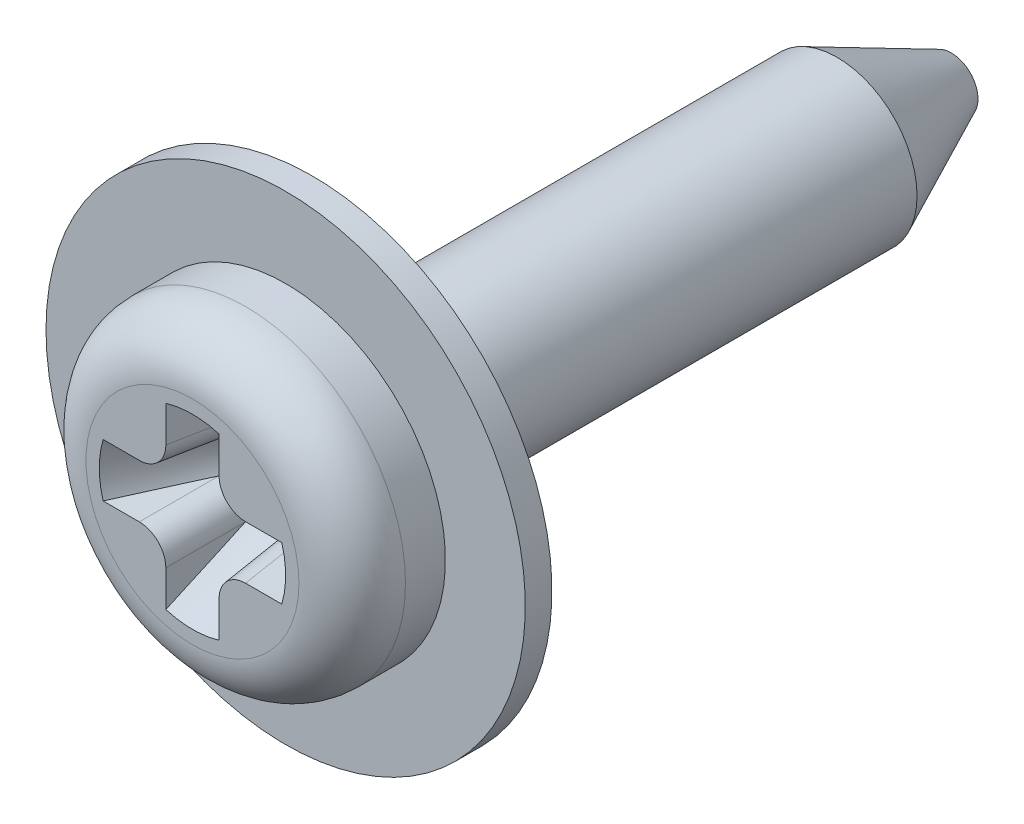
ISO-10303-21;
HEADER;
FILE_DESCRIPTION(('STEP AP214'),'2;1');
FILE_NAME('part.step','',(''),(''),'','','');
FILE_SCHEMA(('AUTOMOTIVE_DESIGN { 1 0 10303 214 1 1 1 1 }'));
ENDSEC;
DATA;
#1=APPLICATION_CONTEXT('core data for automotive mechanical design processes');
#2=APPLICATION_PROTOCOL_DEFINITION('international standard','automotive_design',2000,#1);
#3=PRODUCT_CONTEXT('',#1,'mechanical');
#4=PRODUCT('Part','Part','',(#3));
#5=PRODUCT_RELATED_PRODUCT_CATEGORY('part','',(#4));
#6=PRODUCT_DEFINITION_FORMATION('','',#4);
#7=PRODUCT_DEFINITION_CONTEXT('part definition',#1,'design');
#8=PRODUCT_DEFINITION('design','',#6,#7);
#9=PRODUCT_DEFINITION_SHAPE('','',#8);
#10=(LENGTH_UNIT() NAMED_UNIT(*) SI_UNIT(.MILLI.,.METRE.));
#11=(NAMED_UNIT(*) PLANE_ANGLE_UNIT() SI_UNIT($,.RADIAN.));
#12=(NAMED_UNIT(*) SI_UNIT($,.STERADIAN.) SOLID_ANGLE_UNIT());
#13=UNCERTAINTY_MEASURE_WITH_UNIT(LENGTH_MEASURE(1.E-05),#10,'distance_accuracy_value','');
#14=(GEOMETRIC_REPRESENTATION_CONTEXT(3) GLOBAL_UNCERTAINTY_ASSIGNED_CONTEXT((#13)) GLOBAL_UNIT_ASSIGNED_CONTEXT((#10,
#11,#12)) REPRESENTATION_CONTEXT('',''));
#15=CARTESIAN_POINT('',(0.,0.,0.));
#16=DIRECTION('',(0.,0.,1.));
#17=DIRECTION('',(1.,0.,0.));
#18=AXIS2_PLACEMENT_3D('',#15,#16,#17);
#19=CARTESIAN_POINT('',(0.,0.,14.25));
#20=DIRECTION('',(0.,0.,1.));
#21=DIRECTION('',(1.,0.,0.));
#22=AXIS2_PLACEMENT_3D('',#19,#20,#21);
#23=CONICAL_SURFACE('',#22,1.75,0.5235987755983);
#24=CARTESIAN_POINT('',(0.500017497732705,1.67716625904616,14.2502));
#25=CARTESIAN_POINT('',(0.489050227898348,1.60490105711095,14.1248435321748));
#26=CARTESIAN_POINT('',(0.478085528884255,1.53258418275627,13.9995164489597));
#27=CARTESIAN_POINT('',(0.456166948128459,1.38773778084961,13.7489859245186));
#28=CARTESIAN_POINT('',(0.445213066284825,1.31520825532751,13.6237824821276));
#29=CARTESIAN_POINT('',(0.423321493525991,1.16982525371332,13.3735606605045));
#30=CARTESIAN_POINT('',(0.412383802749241,1.09697177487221,13.2485422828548));
#31=CARTESIAN_POINT('',(0.395999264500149,0.98725732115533,13.0612661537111));
#32=CARTESIAN_POINT('',(0.390541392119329,0.950613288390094,12.9988823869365));
#33=CARTESIAN_POINT('',(0.379636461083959,0.877113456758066,12.8742384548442));
#34=CARTESIAN_POINT('',(0.374189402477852,0.840257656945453,12.8119782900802));
#35=CARTESIAN_POINT('',(0.368749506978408,0.803262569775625,12.7498));
#36=B_SPLINE_CURVE_WITH_KNOTS('',3,(#24,#25,#26,#27,#28,#29,#30,#31,#32,#33,#34,#35),
.UNSPECIFIED.,.F.,.F.,(4,2,2,2,2,4),(0.,0.435328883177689,0.870653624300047,1.30598206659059,
1.52364836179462,1.74131562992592),.UNSPECIFIED.);
#37=CARTESIAN_POINT('',(0.5,1.67705098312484,14.25));
#38=VERTEX_POINT('',#37);
#39=CARTESIAN_POINT('',(0.379752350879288,0.877849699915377,12.8755630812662));
#40=VERTEX_POINT('',#39);
#41=EDGE_CURVE('E150',#38,#40,#36,.T.);
#42=ORIENTED_EDGE('',*,*,#41,.F.);
#43=CARTESIAN_POINT('',(0.,0.,14.25));
#44=DIRECTION('',(0.,0.,1.));
#45=DIRECTION('',(1.,0.,0.));
#46=AXIS2_PLACEMENT_3D('',#43,#44,#45);
#47=CIRCLE('',#46,1.75);
#48=CARTESIAN_POINT('',(-0.5,1.67705098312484,14.25));
#49=VERTEX_POINT('',#48);
#50=EDGE_CURVE('E161',#38,#49,#47,.T.);
#51=ORIENTED_EDGE('',*,*,#50,.T.);
#52=CARTESIAN_POINT('',(-0.368749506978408,0.803262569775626,12.7498));
#53=CARTESIAN_POINT('',(-0.376113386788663,0.853329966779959,12.8339695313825));
#54=CARTESIAN_POINT('',(-0.383489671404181,0.903155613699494,12.9182808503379));
#55=CARTESIAN_POINT('',(-0.398259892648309,1.00246023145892,13.0871052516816));
#56=CARTESIAN_POINT('',(-0.405653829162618,1.05193920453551,13.1716183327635));
#57=CARTESIAN_POINT('',(-0.427851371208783,1.20006129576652,13.4253373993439));
#58=CARTESIAN_POINT('',(-0.44267086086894,1.29839060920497,13.5947249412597));
#59=CARTESIAN_POINT('',(-0.46458277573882,1.44336944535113,13.8451792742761));
#60=CARTESIAN_POINT('',(-0.471667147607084,1.49017956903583,13.9261540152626));
#61=CARTESIAN_POINT('',(-0.485839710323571,1.58372456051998,14.0881471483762));
#62=CARTESIAN_POINT('',(-0.492927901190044,1.63045942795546,14.1691655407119));
#63=CARTESIAN_POINT('',(-0.500017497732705,1.67716625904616,14.2502));
#64=B_SPLINE_CURVE_WITH_KNOTS('',3,(#52,#53,#54,#55,#56,#57,#58,#59,#60,#61,#62,#63),
.UNSPECIFIED.,.F.,.F.,(4,2,2,2,2,4),(0.,0.294632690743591,0.589263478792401,1.17851899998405,
1.45991651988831,1.74131539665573),.UNSPECIFIED.);
#65=CARTESIAN_POINT('',(-0.379752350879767,0.877849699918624,12.8755630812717));
#66=VERTEX_POINT('',#65);
#67=EDGE_CURVE('E170',#66,#49,#64,.T.);
#68=ORIENTED_EDGE('',*,*,#67,.F.);
#69=CARTESIAN_POINT('',(-0.379752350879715,0.877849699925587,12.8755630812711));
#70=CARTESIAN_POINT('',(-0.377885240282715,0.865414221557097,12.8544893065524));
#71=CARTESIAN_POINT('',(-0.376393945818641,0.852825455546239,12.8334888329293));
#72=CARTESIAN_POINT('',(-0.374162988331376,0.827341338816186,12.7916344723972));
#73=CARTESIAN_POINT('',(-0.373423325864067,0.814445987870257,12.7707805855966));
#74=CARTESIAN_POINT('',(-0.373059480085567,0.801397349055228,12.75));
#75=B_SPLINE_CURVE_WITH_KNOTS('',3,(#69,#70,#71,#72,#73,#74),.UNSPECIFIED.,.F.,.F.,(4,2,4),(0.,
0.0735899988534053,0.147180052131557),.UNSPECIFIED.);
#76=CARTESIAN_POINT('',(-0.373059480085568,0.801397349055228,12.75));
#77=VERTEX_POINT('',#76);
#78=EDGE_CURVE('E238',#66,#77,#75,.T.);
#79=ORIENTED_EDGE('',*,*,#78,.T.);
#80=CARTESIAN_POINT('',(0.,0.,12.75));
#81=DIRECTION('',(0.,0.,1.));
#82=DIRECTION('',(1.,0.,0.));
#83=AXIS2_PLACEMENT_3D('',#80,#81,#82);
#84=CIRCLE('',#83,0.88397459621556);
#85=CARTESIAN_POINT('',(0.373059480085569,0.801397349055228,12.75));
#86=VERTEX_POINT('',#85);
#87=EDGE_CURVE('E331',#86,#77,#84,.T.);
#88=ORIENTED_EDGE('',*,*,#87,.F.);
#89=CARTESIAN_POINT('',(0.373059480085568,0.801397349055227,12.75));
#90=CARTESIAN_POINT('',(0.373423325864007,0.814445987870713,12.7707805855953));
#91=CARTESIAN_POINT('',(0.374162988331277,0.827341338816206,12.7916344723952));
#92=CARTESIAN_POINT('',(0.376393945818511,0.852825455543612,12.833488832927));
#93=CARTESIAN_POINT('',(0.377885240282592,0.865414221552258,12.8544893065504));
#94=CARTESIAN_POINT('',(0.379752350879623,0.877849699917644,12.87556308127));
#95=B_SPLINE_CURVE_WITH_KNOTS('',3,(#89,#90,#91,#92,#93,#94),.UNSPECIFIED.,.F.,.F.,(4,2,4),(0.,
0.0735900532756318,0.147180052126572),.UNSPECIFIED.);
#96=EDGE_CURVE('E270',#86,#40,#95,.T.);
#97=ORIENTED_EDGE('',*,*,#96,.T.);
#98=EDGE_LOOP('',(#42,#51,#68,#79,#88,#97));
#99=FACE_BOUND('',#98,.T.);
#100=ADVANCED_FACE('F29',(#99),#23,.F.);
#101=CARTESIAN_POINT('',(0.803262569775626,0.368749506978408,12.7498));
#102=CARTESIAN_POINT('',(0.853329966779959,0.376113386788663,12.8339695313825));
#103=CARTESIAN_POINT('',(0.903155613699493,0.383489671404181,12.9182808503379));
#104=CARTESIAN_POINT('',(1.00246023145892,0.398259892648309,13.0871052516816));
#105=CARTESIAN_POINT('',(1.05193920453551,0.405653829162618,13.1716183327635));
#106=CARTESIAN_POINT('',(1.20006129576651,0.427851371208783,13.4253373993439));
#107=CARTESIAN_POINT('',(1.29839060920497,0.44267086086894,13.5947249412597));
#108=CARTESIAN_POINT('',(1.44336944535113,0.46458277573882,13.8451792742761));
#109=CARTESIAN_POINT('',(1.49017956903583,0.471667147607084,13.9261540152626));
#110=CARTESIAN_POINT('',(1.58372456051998,0.485839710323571,14.0881471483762));
#111=CARTESIAN_POINT('',(1.63045942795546,0.492927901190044,14.1691655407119));
#112=CARTESIAN_POINT('',(1.67716625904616,0.500017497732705,14.2502));
#113=B_SPLINE_CURVE_WITH_KNOTS('',3,(#101,#102,#103,#104,#105,#106,#107,#108,#109,#110,#111,
#112),.UNSPECIFIED.,.F.,.F.,(4,2,2,2,2,4),(0.,0.294632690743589,0.589263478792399,
1.17851899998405,1.45991651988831,1.74131539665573),.UNSPECIFIED.);
#114=CARTESIAN_POINT('',(0.877849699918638,0.379752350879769,12.8755630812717));
#115=VERTEX_POINT('',#114);
#116=CARTESIAN_POINT('',(1.67705098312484,0.5,14.25));
#117=VERTEX_POINT('',#116);
#118=EDGE_CURVE('E142',#115,#117,#113,.T.);
#119=ORIENTED_EDGE('',*,*,#118,.F.);
#120=CARTESIAN_POINT('',(0.877849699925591,0.379752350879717,12.8755630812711));
#121=CARTESIAN_POINT('',(0.865414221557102,0.377885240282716,12.8544893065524));
#122=CARTESIAN_POINT('',(0.852825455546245,0.376393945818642,12.8334888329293));
#123=CARTESIAN_POINT('',(0.82734133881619,0.374162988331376,12.7916344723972));
#124=CARTESIAN_POINT('',(0.81444598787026,0.373423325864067,12.7707805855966));
#125=CARTESIAN_POINT('',(0.801397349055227,0.373059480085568,12.75));
#126=B_SPLINE_CURVE_WITH_KNOTS('',3,(#120,#121,#122,#123,#124,#125),.UNSPECIFIED.,.F.,.F.,(4,2,
4),(0.,0.0735899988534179,0.147180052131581),.UNSPECIFIED.);
#127=CARTESIAN_POINT('',(0.801397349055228,0.373059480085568,12.75));
#128=VERTEX_POINT('',#127);
#129=EDGE_CURVE('E265',#115,#128,#126,.T.);
#130=ORIENTED_EDGE('',*,*,#129,.T.);
#131=CARTESIAN_POINT('',(0.801397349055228,-0.373059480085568,12.75));
#132=VERTEX_POINT('',#131);
#133=EDGE_CURVE('E44',#132,#128,#84,.T.);
#134=ORIENTED_EDGE('',*,*,#133,.F.);
#135=CARTESIAN_POINT('',(0.801397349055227,-0.373059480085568,12.75));
#136=CARTESIAN_POINT('',(0.814445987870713,-0.373423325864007,12.7707805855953));
#137=CARTESIAN_POINT('',(0.827341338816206,-0.374162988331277,12.7916344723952));
#138=CARTESIAN_POINT('',(0.852825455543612,-0.37639394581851,12.833488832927));
#139=CARTESIAN_POINT('',(0.865414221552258,-0.377885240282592,12.8544893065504));
#140=CARTESIAN_POINT('',(0.877849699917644,-0.379752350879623,12.87556308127));
#141=B_SPLINE_CURVE_WITH_KNOTS('',3,(#135,#136,#137,#138,#139,#140),.UNSPECIFIED.,.F.,.F.,(4,2,
4),(0.,0.0735900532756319,0.147180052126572),.UNSPECIFIED.);
#142=CARTESIAN_POINT('',(0.877849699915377,-0.379752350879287,12.8755630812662));
#143=VERTEX_POINT('',#142);
#144=EDGE_CURVE('E431',#132,#143,#141,.T.);
#145=ORIENTED_EDGE('',*,*,#144,.T.);
#146=CARTESIAN_POINT('',(1.67716625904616,-0.500017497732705,14.2502));
#147=CARTESIAN_POINT('',(1.60490105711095,-0.489050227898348,14.1248435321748));
#148=CARTESIAN_POINT('',(1.53258418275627,-0.478085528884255,13.9995164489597));
#149=CARTESIAN_POINT('',(1.38773778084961,-0.456166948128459,13.7489859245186));
#150=CARTESIAN_POINT('',(1.31520825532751,-0.445213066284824,13.6237824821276));
#151=CARTESIAN_POINT('',(1.16982525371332,-0.423321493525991,13.3735606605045));
#152=CARTESIAN_POINT('',(1.09697177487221,-0.412383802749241,13.2485422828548));
#153=CARTESIAN_POINT('',(0.98725732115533,-0.395999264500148,13.0612661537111));
#154=CARTESIAN_POINT('',(0.950613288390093,-0.390541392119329,12.9988823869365));
#155=CARTESIAN_POINT('',(0.877113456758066,-0.379636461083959,12.8742384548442));
#156=CARTESIAN_POINT('',(0.840257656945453,-0.374189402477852,12.8119782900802));
#157=CARTESIAN_POINT('',(0.803262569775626,-0.368749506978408,12.7498));
#158=B_SPLINE_CURVE_WITH_KNOTS('',3,(#146,#147,#148,#149,#150,#151,#152,#153,#154,#155,#156,
#157),.UNSPECIFIED.,.F.,.F.,(4,2,2,2,2,4),(0.,0.435328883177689,0.870653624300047,
1.30598206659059,1.52364836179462,1.74131562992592),.UNSPECIFIED.);
#159=CARTESIAN_POINT('',(1.67705098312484,-0.5,14.25));
#160=VERTEX_POINT('',#159);
#161=EDGE_CURVE('E151',#160,#143,#158,.T.);
#162=ORIENTED_EDGE('',*,*,#161,.F.);
#163=EDGE_CURVE('E155',#160,#117,#47,.T.);
#164=ORIENTED_EDGE('',*,*,#163,.T.);
#165=EDGE_LOOP('',(#119,#130,#134,#145,#162,#164));
#166=FACE_BOUND('',#165,.T.);
#167=ADVANCED_FACE('F156',(#166),#23,.F.);
#168=CARTESIAN_POINT('',(0.368749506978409,-0.803262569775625,12.7498));
#169=CARTESIAN_POINT('',(0.376113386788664,-0.853329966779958,12.8339695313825));
#170=CARTESIAN_POINT('',(0.383489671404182,-0.903155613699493,12.9182808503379));
#171=CARTESIAN_POINT('',(0.39825989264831,-1.00246023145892,13.0871052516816));
#172=CARTESIAN_POINT('',(0.405653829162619,-1.05193920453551,13.1716183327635));
#173=CARTESIAN_POINT('',(0.427851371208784,-1.20006129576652,13.4253373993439));
#174=CARTESIAN_POINT('',(0.442670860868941,-1.29839060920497,13.5947249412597));
#175=CARTESIAN_POINT('',(0.464582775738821,-1.44336944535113,13.8451792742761));
#176=CARTESIAN_POINT('',(0.471667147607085,-1.49017956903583,13.9261540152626));
#177=CARTESIAN_POINT('',(0.485839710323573,-1.58372456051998,14.0881471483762));
#178=CARTESIAN_POINT('',(0.492927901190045,-1.63045942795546,14.1691655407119));
#179=CARTESIAN_POINT('',(0.500017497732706,-1.67716625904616,14.2502));
#180=B_SPLINE_CURVE_WITH_KNOTS('',3,(#168,#169,#170,#171,#172,#173,#174,#175,#176,#177,#178,
#179),.UNSPECIFIED.,.F.,.F.,(4,2,2,2,2,4),(0.,0.294632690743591,0.589263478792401,
1.17851899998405,1.45991651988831,1.74131539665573),.UNSPECIFIED.);
#181=CARTESIAN_POINT('',(0.379752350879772,-0.87784969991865,12.8755630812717));
#182=VERTEX_POINT('',#181);
#183=CARTESIAN_POINT('',(0.500000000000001,-1.67705098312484,14.25));
#184=VERTEX_POINT('',#183);
#185=EDGE_CURVE('E358',#182,#184,#180,.T.);
#186=ORIENTED_EDGE('',*,*,#185,.F.);
#187=CARTESIAN_POINT('',(0.37975235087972,-0.877849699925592,12.8755630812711));
#188=CARTESIAN_POINT('',(0.377885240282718,-0.865414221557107,12.8544893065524));
#189=CARTESIAN_POINT('',(0.376393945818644,-0.852825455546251,12.8334888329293));
#190=CARTESIAN_POINT('',(0.374162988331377,-0.827341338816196,12.7916344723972));
#191=CARTESIAN_POINT('',(0.373423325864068,-0.814445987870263,12.7707805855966));
#192=CARTESIAN_POINT('',(0.373059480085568,-0.801397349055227,12.75));
#193=B_SPLINE_CURVE_WITH_KNOTS('',3,(#187,#188,#189,#190,#191,#192),.UNSPECIFIED.,.F.,.F.,(4,2,
4),(0.,0.0735899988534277,0.147180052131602),.UNSPECIFIED.);
#194=CARTESIAN_POINT('',(0.373059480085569,-0.801397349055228,12.75));
#195=VERTEX_POINT('',#194);
#196=EDGE_CURVE('E419',#182,#195,#193,.T.);
#197=ORIENTED_EDGE('',*,*,#196,.T.);
#198=CARTESIAN_POINT('',(-0.373059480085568,-0.801397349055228,12.75));
#199=VERTEX_POINT('',#198);
#200=EDGE_CURVE('E51',#199,#195,#84,.T.);
#201=ORIENTED_EDGE('',*,*,#200,.F.);
#202=CARTESIAN_POINT('',(-0.373059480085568,-0.801397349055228,12.75));
#203=CARTESIAN_POINT('',(-0.373423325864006,-0.814445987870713,12.7707805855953));
#204=CARTESIAN_POINT('',(-0.374162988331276,-0.827341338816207,12.7916344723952));
#205=CARTESIAN_POINT('',(-0.37639394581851,-0.852825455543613,12.833488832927));
#206=CARTESIAN_POINT('',(-0.377885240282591,-0.865414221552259,12.8544893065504));
#207=CARTESIAN_POINT('',(-0.379752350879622,-0.877849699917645,12.87556308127));
#208=B_SPLINE_CURVE_WITH_KNOTS('',3,(#202,#203,#204,#205,#206,#207),.UNSPECIFIED.,.F.,.F.,(4,2,
4),(0.,0.0735900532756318,0.147180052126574),.UNSPECIFIED.);
#209=CARTESIAN_POINT('',(-0.379752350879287,-0.877849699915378,12.8755630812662));
#210=VERTEX_POINT('',#209);
#211=EDGE_CURVE('E408',#199,#210,#208,.T.);
#212=ORIENTED_EDGE('',*,*,#211,.T.);
#213=CARTESIAN_POINT('',(-0.500017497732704,-1.67716625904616,14.2502));
#214=CARTESIAN_POINT('',(-0.489050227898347,-1.60490105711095,14.1248435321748));
#215=CARTESIAN_POINT('',(-0.478085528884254,-1.53258418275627,13.9995164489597));
#216=CARTESIAN_POINT('',(-0.456166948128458,-1.38773778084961,13.7489859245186));
#217=CARTESIAN_POINT('',(-0.445213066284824,-1.31520825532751,13.6237824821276));
#218=CARTESIAN_POINT('',(-0.42332149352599,-1.16982525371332,13.3735606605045));
#219=CARTESIAN_POINT('',(-0.41238380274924,-1.09697177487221,13.2485422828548));
#220=CARTESIAN_POINT('',(-0.395999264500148,-0.987257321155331,13.0612661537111));
#221=CARTESIAN_POINT('',(-0.390541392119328,-0.950613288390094,12.9988823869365));
#222=CARTESIAN_POINT('',(-0.379636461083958,-0.877113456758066,12.8742384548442));
#223=CARTESIAN_POINT('',(-0.374189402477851,-0.840257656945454,12.8119782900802));
#224=CARTESIAN_POINT('',(-0.368749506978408,-0.803262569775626,12.7498));
#225=B_SPLINE_CURVE_WITH_KNOTS('',3,(#213,#214,#215,#216,#217,#218,#219,#220,#221,#222,#223,
#224),.UNSPECIFIED.,.F.,.F.,(4,2,2,2,2,4),(0.,0.435328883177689,0.870653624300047,
1.30598206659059,1.52364836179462,1.74131562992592),.UNSPECIFIED.);
#226=CARTESIAN_POINT('',(-0.499999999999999,-1.67705098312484,14.25));
#227=VERTEX_POINT('',#226);
#228=EDGE_CURVE('E363',#227,#210,#225,.T.);
#229=ORIENTED_EDGE('',*,*,#228,.F.);
#230=EDGE_CURVE('E163',#227,#184,#47,.T.);
#231=ORIENTED_EDGE('',*,*,#230,.T.);
#232=EDGE_LOOP('',(#186,#197,#201,#212,#229,#231));
#233=FACE_BOUND('',#232,.T.);
#234=ADVANCED_FACE('F387',(#233),#23,.F.);
#235=CARTESIAN_POINT('',(-0.803262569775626,-0.368749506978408,12.7498));
#236=CARTESIAN_POINT('',(-0.853329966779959,-0.376113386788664,12.8339695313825));
#237=CARTESIAN_POINT('',(-0.903155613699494,-0.383489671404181,12.9182808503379));
#238=CARTESIAN_POINT('',(-1.00246023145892,-0.39825989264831,13.0871052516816));
#239=CARTESIAN_POINT('',(-1.05193920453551,-0.405653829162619,13.1716183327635));
#240=CARTESIAN_POINT('',(-1.20006129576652,-0.427851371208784,13.4253373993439));
#241=CARTESIAN_POINT('',(-1.29839060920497,-0.44267086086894,13.5947249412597));
#242=CARTESIAN_POINT('',(-1.44336944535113,-0.46458277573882,13.8451792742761));
#243=CARTESIAN_POINT('',(-1.49017956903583,-0.471667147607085,13.9261540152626));
#244=CARTESIAN_POINT('',(-1.58372456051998,-0.485839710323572,14.0881471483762));
#245=CARTESIAN_POINT('',(-1.63045942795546,-0.492927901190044,14.1691655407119));
#246=CARTESIAN_POINT('',(-1.67716625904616,-0.500017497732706,14.2502));
#247=B_SPLINE_CURVE_WITH_KNOTS('',3,(#235,#236,#237,#238,#239,#240,#241,#242,#243,#244,#245,
#246),.UNSPECIFIED.,.F.,.F.,(4,2,2,2,2,4),(0.,0.294632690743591,0.589263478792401,
1.17851899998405,1.45991651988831,1.74131539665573),.UNSPECIFIED.);
#248=CARTESIAN_POINT('',(-0.877849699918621,-0.379752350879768,12.8755630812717));
#249=VERTEX_POINT('',#248);
#250=CARTESIAN_POINT('',(-1.67705098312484,-0.5,14.25));
#251=VERTEX_POINT('',#250);
#252=EDGE_CURVE('E368',#249,#251,#247,.T.);
#253=ORIENTED_EDGE('',*,*,#252,.F.);
#254=CARTESIAN_POINT('',(-0.877849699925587,-0.379752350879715,12.875563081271));
#255=CARTESIAN_POINT('',(-0.865414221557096,-0.377885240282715,12.8544893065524));
#256=CARTESIAN_POINT('',(-0.852825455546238,-0.376393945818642,12.8334888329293));
#257=CARTESIAN_POINT('',(-0.827341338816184,-0.374162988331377,12.7916344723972));
#258=CARTESIAN_POINT('',(-0.814445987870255,-0.373423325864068,12.7707805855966));
#259=CARTESIAN_POINT('',(-0.801397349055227,-0.373059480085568,12.75));
#260=B_SPLINE_CURVE_WITH_KNOTS('',3,(#254,#255,#256,#257,#258,#259),.UNSPECIFIED.,.F.,.F.,(4,2,
4),(0.,0.0735899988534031,0.147180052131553),.UNSPECIFIED.);
#261=CARTESIAN_POINT('',(-0.801397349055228,-0.373059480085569,12.75));
#262=VERTEX_POINT('',#261);
#263=EDGE_CURVE('E398',#249,#262,#260,.T.);
#264=ORIENTED_EDGE('',*,*,#263,.T.);
#265=CARTESIAN_POINT('',(-0.801397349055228,0.373059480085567,12.75));
#266=VERTEX_POINT('',#265);
#267=EDGE_CURVE('E638',#266,#262,#84,.T.);
#268=ORIENTED_EDGE('',*,*,#267,.F.);
#269=CARTESIAN_POINT('',(-0.801397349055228,0.373059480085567,12.75));
#270=CARTESIAN_POINT('',(-0.814445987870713,0.373423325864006,12.7707805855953));
#271=CARTESIAN_POINT('',(-0.827341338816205,0.374162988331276,12.7916344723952));
#272=CARTESIAN_POINT('',(-0.85282545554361,0.376393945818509,12.833488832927));
#273=CARTESIAN_POINT('',(-0.865414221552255,0.377885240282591,12.8544893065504));
#274=CARTESIAN_POINT('',(-0.877849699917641,0.379752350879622,12.87556308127));
#275=B_SPLINE_CURVE_WITH_KNOTS('',3,(#269,#270,#271,#272,#273,#274),.UNSPECIFIED.,.F.,.F.,(4,2,
4),(0.,0.0735900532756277,0.147180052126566),.UNSPECIFIED.);
#276=CARTESIAN_POINT('',(-0.877849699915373,0.379752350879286,12.8755630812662));
#277=VERTEX_POINT('',#276);
#278=EDGE_CURVE('E237',#266,#277,#275,.T.);
#279=ORIENTED_EDGE('',*,*,#278,.T.);
#280=CARTESIAN_POINT('',(-1.67716625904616,0.500017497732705,14.2502));
#281=CARTESIAN_POINT('',(-1.60490105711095,0.489050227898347,14.1248435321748));
#282=CARTESIAN_POINT('',(-1.53258418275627,0.478085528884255,13.9995164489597));
#283=CARTESIAN_POINT('',(-1.38773778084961,0.456166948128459,13.7489859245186));
#284=CARTESIAN_POINT('',(-1.31520825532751,0.445213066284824,13.6237824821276));
#285=CARTESIAN_POINT('',(-1.16982525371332,0.42332149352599,13.3735606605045));
#286=CARTESIAN_POINT('',(-1.09697177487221,0.41238380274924,13.2485422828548));
#287=CARTESIAN_POINT('',(-0.987257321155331,0.395999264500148,13.0612661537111));
#288=CARTESIAN_POINT('',(-0.950613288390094,0.390541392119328,12.9988823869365));
#289=CARTESIAN_POINT('',(-0.877113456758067,0.379636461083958,12.8742384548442));
#290=CARTESIAN_POINT('',(-0.840257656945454,0.374189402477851,12.8119782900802));
#291=CARTESIAN_POINT('',(-0.803262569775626,0.368749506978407,12.7498));
#292=B_SPLINE_CURVE_WITH_KNOTS('',3,(#280,#281,#282,#283,#284,#285,#286,#287,#288,#289,#290,
#291),.UNSPECIFIED.,.F.,.F.,(4,2,2,2,2,4),(0.,0.435328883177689,0.870653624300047,
1.30598206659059,1.52364836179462,1.74131562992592),.UNSPECIFIED.);
#293=CARTESIAN_POINT('',(-1.67705098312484,0.499999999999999,14.25));
#294=VERTEX_POINT('',#293);
#295=EDGE_CURVE('E182',#294,#277,#292,.T.);
#296=ORIENTED_EDGE('',*,*,#295,.F.);
#297=EDGE_CURVE('E402',#294,#251,#47,.T.);
#298=ORIENTED_EDGE('',*,*,#297,.T.);
#299=EDGE_LOOP('',(#253,#264,#268,#279,#296,#298));
#300=FACE_BOUND('',#299,.T.);
#301=ADVANCED_FACE('F206',(#300),#23,.F.);
#302=CARTESIAN_POINT('',(0.,0.,12.75));
#303=DIRECTION('',(0.,0.,1.));
#304=DIRECTION('',(1.,0.,0.));
#305=AXIS2_PLACEMENT_3D('',#302,#303,#304);
#306=CONICAL_SURFACE('',#305,0.88397459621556,0.78539816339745);
#307=CARTESIAN_POINT('',(0.,0.,11.9));
#308=DIRECTION('',(0.,0.,1.));
#309=DIRECTION('',(1.,0.,0.));
#310=AXIS2_PLACEMENT_3D('',#307,#308,#309);
#311=CIRCLE('',#310,0.0339745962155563);
#312=CARTESIAN_POINT('',(0.0339745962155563,0.,11.9));
#313=VERTEX_POINT('',#312);
#314=EDGE_CURVE('E328',#313,#313,#311,.T.);
#315=ORIENTED_EDGE('',*,*,#314,.F.);
#316=EDGE_LOOP('',(#315));
#317=FACE_BOUND('',#316,.T.);
#318=ORIENTED_EDGE('',*,*,#133,.T.);
#319=CARTESIAN_POINT('',(0.801397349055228,0.373059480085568,12.75));
#320=CARTESIAN_POINT('',(0.78987209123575,0.373567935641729,12.7397677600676));
#321=CARTESIAN_POINT('',(0.778264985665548,0.374440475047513,12.7296585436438));
#322=CARTESIAN_POINT('',(0.754821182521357,0.377011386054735,12.7097390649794));
#323=CARTESIAN_POINT('',(0.742983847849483,0.37871250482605,12.6999299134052));
#324=CARTESIAN_POINT('',(0.706721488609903,0.385274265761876,12.6707954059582));
#325=CARTESIAN_POINT('',(0.681952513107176,0.391582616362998,12.6521320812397));
#326=CARTESIAN_POINT('',(0.643857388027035,0.405015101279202,12.6266035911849));
#327=CARTESIAN_POINT('',(0.630779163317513,0.410275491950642,12.6183921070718));
#328=CARTESIAN_POINT('',(0.604573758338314,0.422395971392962,12.6034367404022));
#329=CARTESIAN_POINT('',(0.591447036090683,0.429249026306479,12.5966866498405));
#330=CARTESIAN_POINT('',(0.567598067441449,0.443443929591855,12.5862164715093));
#331=CARTESIAN_POINT('',(0.556850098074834,0.450499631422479,12.5821750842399));
#332=CARTESIAN_POINT('',(0.535744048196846,0.465890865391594,12.5758958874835));
#333=CARTESIAN_POINT('',(0.52538556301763,0.474225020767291,12.5736561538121));
#334=CARTESIAN_POINT('',(0.505360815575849,0.492087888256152,12.5712636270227));
#335=CARTESIAN_POINT('',(0.495699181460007,0.501623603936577,12.5711236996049));
#336=CARTESIAN_POINT('',(0.477489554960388,0.521514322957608,12.5729850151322));
#337=CARTESIAN_POINT('',(0.468942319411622,0.531869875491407,12.5749877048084));
#338=CARTESIAN_POINT('',(0.451950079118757,0.554605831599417,12.5813061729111));
#339=CARTESIAN_POINT('',(0.44371497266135,0.567056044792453,12.5859252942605));
#340=CARTESIAN_POINT('',(0.42891158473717,0.592109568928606,12.5970362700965));
#341=CARTESIAN_POINT('',(0.422347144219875,0.604713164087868,12.6035323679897));
#342=CARTESIAN_POINT('',(0.406963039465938,0.637886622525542,12.6224225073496));
#343=CARTESIAN_POINT('',(0.39939171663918,0.658388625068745,12.6359292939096));
#344=CARTESIAN_POINT('',(0.387317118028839,0.698890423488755,12.6649163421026));
#345=CARTESIAN_POINT('',(0.382823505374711,0.718888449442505,12.680402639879));
#346=CARTESIAN_POINT('',(0.377799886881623,0.749267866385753,12.7051290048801));
#347=CARTESIAN_POINT('',(0.37639740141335,0.759844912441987,12.7139687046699));
#348=CARTESIAN_POINT('',(0.374255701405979,0.780770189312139,12.7318425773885));
#349=CARTESIAN_POINT('',(0.373511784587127,0.79111951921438,12.7408748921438));
#350=CARTESIAN_POINT('',(0.373059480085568,0.801397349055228,12.75));
#351=B_SPLINE_CURVE_WITH_KNOTS('',3,(#319,#320,#321,#322,#323,#324,#325,#326,#327,#328,#329,
#330,#331,#332,#333,#334,#335,#336,#337,#338,#339,#340,#341,#342,#343,#344,#345,#346,#347,#348,
#349,#350),.UNSPECIFIED.,.F.,.F.,(4,2,2,2,2,2,2,2,2,2,2,2,2,2,2,4),(0.,0.0462354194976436,
0.0926251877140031,0.187043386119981,0.235884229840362,0.284513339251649,0.324789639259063,
0.365022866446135,0.405502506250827,0.446009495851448,0.492626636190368,0.539350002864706,
0.615998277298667,0.692886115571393,0.734436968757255,0.775688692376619),.UNSPECIFIED.);
#352=EDGE_CURVE('E221',#128,#86,#351,.T.);
#353=ORIENTED_EDGE('',*,*,#352,.T.);
#354=ORIENTED_EDGE('',*,*,#87,.T.);
#355=CARTESIAN_POINT('',(-0.373059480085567,0.801397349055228,12.75));
#356=CARTESIAN_POINT('',(-0.373567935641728,0.789872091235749,12.7397677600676));
#357=CARTESIAN_POINT('',(-0.374440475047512,0.778264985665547,12.7296585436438));
#358=CARTESIAN_POINT('',(-0.377011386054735,0.754821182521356,12.7097390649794));
#359=CARTESIAN_POINT('',(-0.378712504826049,0.742983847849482,12.6999299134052));
#360=CARTESIAN_POINT('',(-0.385274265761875,0.706721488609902,12.6707954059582));
#361=CARTESIAN_POINT('',(-0.391582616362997,0.681952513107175,12.6521320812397));
#362=CARTESIAN_POINT('',(-0.405015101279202,0.643857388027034,12.6266035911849));
#363=CARTESIAN_POINT('',(-0.410275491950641,0.630779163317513,12.6183921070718));
#364=CARTESIAN_POINT('',(-0.422395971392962,0.604573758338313,12.6034367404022));
#365=CARTESIAN_POINT('',(-0.429249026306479,0.591447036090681,12.5966866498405));
#366=CARTESIAN_POINT('',(-0.443443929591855,0.567598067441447,12.5862164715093));
#367=CARTESIAN_POINT('',(-0.450499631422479,0.556850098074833,12.5821750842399));
#368=CARTESIAN_POINT('',(-0.465890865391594,0.535744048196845,12.5758958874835));
#369=CARTESIAN_POINT('',(-0.474225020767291,0.525385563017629,12.5736561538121));
#370=CARTESIAN_POINT('',(-0.492087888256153,0.505360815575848,12.5712636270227));
#371=CARTESIAN_POINT('',(-0.501623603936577,0.495699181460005,12.5711236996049));
#372=CARTESIAN_POINT('',(-0.521514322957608,0.477489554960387,12.5729850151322));
#373=CARTESIAN_POINT('',(-0.531869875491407,0.46894231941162,12.5749877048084));
#374=CARTESIAN_POINT('',(-0.554605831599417,0.451950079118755,12.5813061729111));
#375=CARTESIAN_POINT('',(-0.567056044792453,0.443714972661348,12.5859252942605));
#376=CARTESIAN_POINT('',(-0.592109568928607,0.428911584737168,12.5970362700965));
#377=CARTESIAN_POINT('',(-0.604713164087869,0.422347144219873,12.6035323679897));
#378=CARTESIAN_POINT('',(-0.637886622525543,0.406963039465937,12.6224225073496));
#379=CARTESIAN_POINT('',(-0.658388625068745,0.399391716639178,12.6359292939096));
#380=CARTESIAN_POINT('',(-0.698890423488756,0.387317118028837,12.6649163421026));
#381=CARTESIAN_POINT('',(-0.718888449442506,0.38282350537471,12.680402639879));
#382=CARTESIAN_POINT('',(-0.749267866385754,0.377799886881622,12.7051290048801));
#383=CARTESIAN_POINT('',(-0.759844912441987,0.376397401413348,12.7139687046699));
#384=CARTESIAN_POINT('',(-0.780770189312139,0.374255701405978,12.7318425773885));
#385=CARTESIAN_POINT('',(-0.791119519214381,0.373511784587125,12.7408748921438));
#386=CARTESIAN_POINT('',(-0.801397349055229,0.373059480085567,12.75));
#387=B_SPLINE_CURVE_WITH_KNOTS('',3,(#355,#356,#357,#358,#359,#360,#361,#362,#363,#364,#365,
#366,#367,#368,#369,#370,#371,#372,#373,#374,#375,#376,#377,#378,#379,#380,#381,#382,#383,#384,
#385,#386),.UNSPECIFIED.,.F.,.F.,(4,2,2,2,2,2,2,2,2,2,2,2,2,2,2,4),(0.,0.0462354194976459,
0.0926251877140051,0.187043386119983,0.235884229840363,0.284513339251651,0.324789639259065,
0.365022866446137,0.405502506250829,0.446009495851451,0.492626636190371,0.539350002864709,
0.61599827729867,0.692886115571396,0.734436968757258,0.775688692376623),.UNSPECIFIED.);
#388=EDGE_CURVE('E229',#77,#266,#387,.T.);
#389=ORIENTED_EDGE('',*,*,#388,.T.);
#390=ORIENTED_EDGE('',*,*,#267,.T.);
#391=CARTESIAN_POINT('',(-0.801397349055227,-0.373059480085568,12.75));
#392=CARTESIAN_POINT('',(-0.789872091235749,-0.373567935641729,12.7397677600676));
#393=CARTESIAN_POINT('',(-0.778264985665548,-0.374440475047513,12.7296585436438));
#394=CARTESIAN_POINT('',(-0.754821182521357,-0.377011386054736,12.7097390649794));
#395=CARTESIAN_POINT('',(-0.742983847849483,-0.37871250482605,12.6999299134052));
#396=CARTESIAN_POINT('',(-0.706721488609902,-0.385274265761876,12.6707954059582));
#397=CARTESIAN_POINT('',(-0.681952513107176,-0.391582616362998,12.6521320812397));
#398=CARTESIAN_POINT('',(-0.643857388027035,-0.405015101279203,12.6266035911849));
#399=CARTESIAN_POINT('',(-0.630779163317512,-0.410275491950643,12.6183921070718));
#400=CARTESIAN_POINT('',(-0.604573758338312,-0.422395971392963,12.6034367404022));
#401=CARTESIAN_POINT('',(-0.591447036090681,-0.42924902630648,12.5966866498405));
#402=CARTESIAN_POINT('',(-0.567598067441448,-0.443443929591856,12.5862164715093));
#403=CARTESIAN_POINT('',(-0.556850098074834,-0.45049963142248,12.5821750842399));
#404=CARTESIAN_POINT('',(-0.535744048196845,-0.465890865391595,12.5758958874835));
#405=CARTESIAN_POINT('',(-0.525385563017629,-0.474225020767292,12.5736561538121));
#406=CARTESIAN_POINT('',(-0.505360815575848,-0.492087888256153,12.5712636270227));
#407=CARTESIAN_POINT('',(-0.495699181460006,-0.501623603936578,12.5711236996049));
#408=CARTESIAN_POINT('',(-0.477489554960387,-0.521514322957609,12.5729850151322));
#409=CARTESIAN_POINT('',(-0.468942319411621,-0.531869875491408,12.5749877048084));
#410=CARTESIAN_POINT('',(-0.451950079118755,-0.554605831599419,12.5813061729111));
#411=CARTESIAN_POINT('',(-0.443714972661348,-0.567056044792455,12.5859252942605));
#412=CARTESIAN_POINT('',(-0.428911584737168,-0.592109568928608,12.5970362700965));
#413=CARTESIAN_POINT('',(-0.422347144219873,-0.60471316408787,12.6035323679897));
#414=CARTESIAN_POINT('',(-0.406963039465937,-0.637886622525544,12.6224225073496));
#415=CARTESIAN_POINT('',(-0.399391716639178,-0.658388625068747,12.6359292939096));
#416=CARTESIAN_POINT('',(-0.387317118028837,-0.698890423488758,12.6649163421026));
#417=CARTESIAN_POINT('',(-0.38282350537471,-0.718888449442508,12.680402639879));
#418=CARTESIAN_POINT('',(-0.377799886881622,-0.749267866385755,12.7051290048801));
#419=CARTESIAN_POINT('',(-0.376397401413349,-0.759844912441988,12.7139687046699));
#420=CARTESIAN_POINT('',(-0.374255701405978,-0.780770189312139,12.7318425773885));
#421=CARTESIAN_POINT('',(-0.373511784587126,-0.79111951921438,12.7408748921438));
#422=CARTESIAN_POINT('',(-0.373059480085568,-0.801397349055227,12.75));
#423=B_SPLINE_CURVE_WITH_KNOTS('',3,(#391,#392,#393,#394,#395,#396,#397,#398,#399,#400,#401,
#402,#403,#404,#405,#406,#407,#408,#409,#410,#411,#412,#413,#414,#415,#416,#417,#418,#419,#420,
#421,#422),.UNSPECIFIED.,.F.,.F.,(4,2,2,2,2,2,2,2,2,2,2,2,2,2,2,4),(0.,0.0462354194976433,
0.0926251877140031,0.187043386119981,0.235884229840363,0.28451333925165,0.324789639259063,
0.365022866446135,0.405502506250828,0.44600949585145,0.492626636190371,0.539350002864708,
0.61599827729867,0.692886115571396,0.734436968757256,0.775688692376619),.UNSPECIFIED.);
#424=EDGE_CURVE('E407',#262,#199,#423,.T.);
#425=ORIENTED_EDGE('',*,*,#424,.T.);
#426=ORIENTED_EDGE('',*,*,#200,.T.);
#427=CARTESIAN_POINT('',(0.373059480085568,-0.801397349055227,12.75));
#428=CARTESIAN_POINT('',(0.373567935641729,-0.789872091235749,12.7397677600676));
#429=CARTESIAN_POINT('',(0.374440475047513,-0.778264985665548,12.7296585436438));
#430=CARTESIAN_POINT('',(0.377011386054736,-0.754821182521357,12.7097390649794));
#431=CARTESIAN_POINT('',(0.37871250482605,-0.742983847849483,12.6999299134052));
#432=CARTESIAN_POINT('',(0.385274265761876,-0.706721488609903,12.6707954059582));
#433=CARTESIAN_POINT('',(0.391582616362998,-0.681952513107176,12.6521320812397));
#434=CARTESIAN_POINT('',(0.405015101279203,-0.643857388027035,12.6266035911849));
#435=CARTESIAN_POINT('',(0.410275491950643,-0.630779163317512,12.6183921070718));
#436=CARTESIAN_POINT('',(0.422395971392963,-0.604573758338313,12.6034367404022));
#437=CARTESIAN_POINT('',(0.42924902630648,-0.591447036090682,12.5966866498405));
#438=CARTESIAN_POINT('',(0.443443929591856,-0.567598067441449,12.5862164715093));
#439=CARTESIAN_POINT('',(0.45049963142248,-0.556850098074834,12.5821750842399));
#440=CARTESIAN_POINT('',(0.465890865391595,-0.535744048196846,12.5758958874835));
#441=CARTESIAN_POINT('',(0.474225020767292,-0.52538556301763,12.5736561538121));
#442=CARTESIAN_POINT('',(0.492087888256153,-0.505360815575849,12.5712636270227));
#443=CARTESIAN_POINT('',(0.501623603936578,-0.495699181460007,12.5711236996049));
#444=CARTESIAN_POINT('',(0.521514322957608,-0.477489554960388,12.5729850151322));
#445=CARTESIAN_POINT('',(0.531869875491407,-0.468942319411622,12.5749877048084));
#446=CARTESIAN_POINT('',(0.554605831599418,-0.451950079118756,12.5813061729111));
#447=CARTESIAN_POINT('',(0.567056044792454,-0.443714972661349,12.5859252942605));
#448=CARTESIAN_POINT('',(0.592109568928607,-0.428911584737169,12.5970362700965));
#449=CARTESIAN_POINT('',(0.604713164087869,-0.422347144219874,12.6035323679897));
#450=CARTESIAN_POINT('',(0.637886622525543,-0.406963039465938,12.6224225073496));
#451=CARTESIAN_POINT('',(0.658388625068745,-0.39939171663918,12.6359292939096));
#452=CARTESIAN_POINT('',(0.698890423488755,-0.387317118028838,12.6649163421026));
#453=CARTESIAN_POINT('',(0.718888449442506,-0.382823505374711,12.680402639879));
#454=CARTESIAN_POINT('',(0.749267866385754,-0.377799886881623,12.7051290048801));
#455=CARTESIAN_POINT('',(0.759844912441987,-0.37639740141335,12.7139687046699));
#456=CARTESIAN_POINT('',(0.780770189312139,-0.374255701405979,12.7318425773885));
#457=CARTESIAN_POINT('',(0.79111951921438,-0.373511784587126,12.7408748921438));
#458=CARTESIAN_POINT('',(0.801397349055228,-0.373059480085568,12.75));
#459=B_SPLINE_CURVE_WITH_KNOTS('',3,(#427,#428,#429,#430,#431,#432,#433,#434,#435,#436,#437,
#438,#439,#440,#441,#442,#443,#444,#445,#446,#447,#448,#449,#450,#451,#452,#453,#454,#455,#456,
#457,#458),.UNSPECIFIED.,.F.,.F.,(4,2,2,2,2,2,2,2,2,2,2,2,2,2,2,4),(0.,0.0462354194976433,
0.092625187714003,0.187043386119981,0.235884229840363,0.284513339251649,0.324789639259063,
0.365022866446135,0.405502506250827,0.446009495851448,0.492626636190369,0.539350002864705,
0.615998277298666,0.692886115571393,0.734436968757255,0.775688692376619),.UNSPECIFIED.);
#460=EDGE_CURVE('E211',#195,#132,#459,.T.);
#461=ORIENTED_EDGE('',*,*,#460,.T.);
#462=EDGE_LOOP('',(#318,#353,#354,#389,#390,#425,#426,#461));
#463=FACE_BOUND('',#462,.T.);
#464=ADVANCED_FACE('F203',(#317,#463),#306,.F.);
#465=CARTESIAN_POINT('',(0.,0.,12.));
#466=DIRECTION('',(0.,0.,-1.));
#467=DIRECTION('',(-1.,0.,0.));
#468=AXIS2_PLACEMENT_3D('',#465,#466,#467);
#469=CYLINDRICAL_SURFACE('',#468,1.5);
#470=CARTESIAN_POINT('',(0.,0.,2.14450692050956));
#471=DIRECTION('',(0.,0.,1.));
#472=DIRECTION('',(1.,0.,0.));
#473=AXIS2_PLACEMENT_3D('',#470,#471,#472);
#474=CIRCLE('',#473,1.5);
#475=CARTESIAN_POINT('',(1.5,0.,2.14450692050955));
#476=VERTEX_POINT('',#475);
#477=EDGE_CURVE('E317',#476,#476,#474,.T.);
#478=ORIENTED_EDGE('',*,*,#477,.T.);
#479=EDGE_LOOP('',(#478));
#480=FACE_BOUND('',#479,.T.);
#481=CARTESIAN_POINT('',(0.,0.,12.));
#482=DIRECTION('',(0.,0.,1.));
#483=DIRECTION('',(1.,0.,0.));
#484=AXIS2_PLACEMENT_3D('',#481,#482,#483);
#485=CIRCLE('',#484,1.5);
#486=CARTESIAN_POINT('',(1.5,0.,12.));
#487=VERTEX_POINT('',#486);
#488=EDGE_CURVE('E320',#487,#487,#485,.T.);
#489=ORIENTED_EDGE('',*,*,#488,.F.);
#490=EDGE_LOOP('',(#489));
#491=FACE_BOUND('',#490,.T.);
#492=ADVANCED_FACE('F31',(#480,#491),#469,.T.);
#493=CARTESIAN_POINT('',(0.,0.,0.));
#494=DIRECTION('',(0.,0.,1.));
#495=DIRECTION('',(1.,0.,0.));
#496=AXIS2_PLACEMENT_3D('',#493,#494,#495);
#497=PLANE('',#496);
#498=CARTESIAN_POINT('',(0.,0.,0.));
#499=DIRECTION('',(0.,0.,1.));
#500=DIRECTION('',(1.,0.,0.));
#501=AXIS2_PLACEMENT_3D('',#498,#499,#500);
#502=CIRCLE('',#501,0.5);
#503=CARTESIAN_POINT('',(0.5,0.,0.));
#504=VERTEX_POINT('',#503);
#505=EDGE_CURVE('E314',#504,#504,#502,.F.);
#506=ORIENTED_EDGE('',*,*,#505,.T.);
#507=EDGE_LOOP('',(#506));
#508=FACE_BOUND('',#507,.T.);
#509=ADVANCED_FACE('F468',(#508),#497,.F.);
#510=CARTESIAN_POINT('',(0.,0.,12.));
#511=DIRECTION('',(0.,0.,1.));
#512=DIRECTION('',(1.,0.,0.));
#513=AXIS2_PLACEMENT_3D('',#510,#511,#512);
#514=PLANE('',#513);
#515=ORIENTED_EDGE('',*,*,#488,.T.);
#516=EDGE_LOOP('',(#515));
#517=FACE_BOUND('',#516,.T.);
#518=CARTESIAN_POINT('',(0.,0.,12.));
#519=DIRECTION('',(0.,0.,-1.));
#520=DIRECTION('',(-1.,0.,0.));
#521=AXIS2_PLACEMENT_3D('',#518,#519,#520);
#522=CIRCLE('',#521,4.5);
#523=CARTESIAN_POINT('',(-4.5,0.,12.));
#524=VERTEX_POINT('',#523);
#525=EDGE_CURVE('E160',#524,#524,#522,.T.);
#526=ORIENTED_EDGE('',*,*,#525,.T.);
#527=EDGE_LOOP('',(#526));
#528=FACE_BOUND('',#527,.T.);
#529=ADVANCED_FACE('F461',(#517,#528),#514,.F.);
#530=CARTESIAN_POINT('',(0.,0.,2.14450692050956));
#531=DIRECTION('',(0.,0.,1.));
#532=DIRECTION('',(1.,0.,0.));
#533=AXIS2_PLACEMENT_3D('',#530,#531,#532);
#534=CONICAL_SURFACE('',#533,1.5,0.436332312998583);
#535=CARTESIAN_POINT('',(0.5,0.,0.));
#536=CARTESIAN_POINT('',(0.510416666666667,0.,0.0223386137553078));
#537=CARTESIAN_POINT('',(0.520833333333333,0.,0.0446772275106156));
#538=CARTESIAN_POINT('',(0.541666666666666,0.,0.0893544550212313));
#539=CARTESIAN_POINT('',(0.552083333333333,0.,0.111693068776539));
#540=CARTESIAN_POINT('',(0.572916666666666,0.,0.156370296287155));
#541=CARTESIAN_POINT('',(0.583333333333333,0.,0.178708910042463));
#542=CARTESIAN_POINT('',(0.604166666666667,0.,0.223386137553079));
#543=CARTESIAN_POINT('',(0.614583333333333,0.,0.245724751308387));
#544=CARTESIAN_POINT('',(0.635416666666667,0.,0.290401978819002));
#545=CARTESIAN_POINT('',(0.645833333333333,0.,0.31274059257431));
#546=CARTESIAN_POINT('',(0.666666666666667,0.,0.357417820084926));
#547=CARTESIAN_POINT('',(0.677083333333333,0.,0.379756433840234));
#548=CARTESIAN_POINT('',(0.697916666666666,0.,0.424433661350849));
#549=CARTESIAN_POINT('',(0.708333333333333,0.,0.446772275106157));
#550=CARTESIAN_POINT('',(0.729166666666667,0.,0.491449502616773));
#551=CARTESIAN_POINT('',(0.739583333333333,0.,0.513788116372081));
#552=CARTESIAN_POINT('',(0.760416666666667,0.,0.558465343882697));
#553=CARTESIAN_POINT('',(0.770833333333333,0.,0.580803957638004));
#554=CARTESIAN_POINT('',(0.791666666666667,0.,0.62548118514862));
#555=CARTESIAN_POINT('',(0.802083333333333,0.,0.647819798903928));
#556=CARTESIAN_POINT('',(0.822916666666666,0.,0.692497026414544));
#557=CARTESIAN_POINT('',(0.833333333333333,0.,0.714835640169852));
#558=CARTESIAN_POINT('',(0.854166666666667,0.,0.759512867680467));
#559=CARTESIAN_POINT('',(0.864583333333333,0.,0.781851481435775));
#560=CARTESIAN_POINT('',(0.885416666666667,0.,0.826528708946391));
#561=CARTESIAN_POINT('',(0.895833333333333,0.,0.848867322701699));
#562=CARTESIAN_POINT('',(0.916666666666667,0.,0.893544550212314));
#563=CARTESIAN_POINT('',(0.927083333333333,0.,0.915883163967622));
#564=CARTESIAN_POINT('',(0.947916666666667,0.,0.960560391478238));
#565=CARTESIAN_POINT('',(0.958333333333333,0.,0.982899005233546));
#566=CARTESIAN_POINT('',(0.979166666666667,0.,1.02757623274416));
#567=CARTESIAN_POINT('',(0.989583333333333,0.,1.04991484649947));
#568=CARTESIAN_POINT('',(1.01041666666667,0.,1.09459207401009));
#569=CARTESIAN_POINT('',(1.02083333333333,0.,1.11693068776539));
#570=CARTESIAN_POINT('',(1.04166666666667,0.,1.16160791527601));
#571=CARTESIAN_POINT('',(1.05208333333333,0.,1.18394652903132));
#572=CARTESIAN_POINT('',(1.07291666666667,0.,1.22862375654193));
#573=CARTESIAN_POINT('',(1.08333333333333,0.,1.25096237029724));
#574=CARTESIAN_POINT('',(1.10416666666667,0.,1.29563959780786));
#575=CARTESIAN_POINT('',(1.11458333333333,0.,1.31797821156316));
#576=CARTESIAN_POINT('',(1.13541666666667,0.,1.36265543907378));
#577=CARTESIAN_POINT('',(1.14583333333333,0.,1.38499405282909));
#578=CARTESIAN_POINT('',(1.16666666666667,0.,1.4296712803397));
#579=CARTESIAN_POINT('',(1.17708333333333,0.,1.45200989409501));
#580=CARTESIAN_POINT('',(1.19791666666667,0.,1.49668712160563));
#581=CARTESIAN_POINT('',(1.20833333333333,0.,1.51902573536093));
#582=CARTESIAN_POINT('',(1.22916666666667,0.,1.56370296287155));
#583=CARTESIAN_POINT('',(1.23958333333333,0.,1.58604157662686));
#584=CARTESIAN_POINT('',(1.26041666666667,0.,1.63071880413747));
#585=CARTESIAN_POINT('',(1.27083333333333,0.,1.65305741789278));
#586=CARTESIAN_POINT('',(1.29166666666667,0.,1.6977346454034));
#587=CARTESIAN_POINT('',(1.30208333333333,0.,1.72007325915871));
#588=CARTESIAN_POINT('',(1.32291666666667,0.,1.76475048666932));
#589=CARTESIAN_POINT('',(1.33333333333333,0.,1.78708910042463));
#590=CARTESIAN_POINT('',(1.35416666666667,0.,1.83176632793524));
#591=CARTESIAN_POINT('',(1.36458333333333,0.,1.85410494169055));
#592=CARTESIAN_POINT('',(1.38541666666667,0.,1.89878216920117));
#593=CARTESIAN_POINT('',(1.39583333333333,0.,1.92112078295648));
#594=CARTESIAN_POINT('',(1.41666666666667,0.,1.96579801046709));
#595=CARTESIAN_POINT('',(1.42708333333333,0.,1.9881366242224));
#596=CARTESIAN_POINT('',(1.44791666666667,0.,2.03281385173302));
#597=CARTESIAN_POINT('',(1.45833333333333,0.,2.05515246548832));
#598=CARTESIAN_POINT('',(1.47916666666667,0.,2.09982969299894));
#599=CARTESIAN_POINT('',(1.48958333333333,0.,2.12216830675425));
#600=CARTESIAN_POINT('',(1.5,0.,2.14450692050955));
#601=B_SPLINE_CURVE_WITH_KNOTS('',3,(#535,#536,#537,#538,#539,#540,#541,#542,#543,#544,#545,
#546,#547,#548,#549,#550,#551,#552,#553,#554,#555,#556,#557,#558,#559,#560,#561,#562,#563,#564,
#565,#566,#567,#568,#569,#570,#571,#572,#573,#574,#575,#576,#577,#578,#579,#580,#581,#582,#583,
#584,#585,#586,#587,#588,#589,#590,#591,#592,#593,#594,#595,#596,#597,#598,#599,#600),
.UNSPECIFIED.,.F.,.F.,(4,2,2,2,2,2,2,2,2,2,2,2,2,2,2,2,2,2,2,2,2,2,2,2,2,2,2,2,2,2,2,2,4),(0.,
0.0739437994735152,0.147887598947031,0.221831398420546,0.295775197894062,0.369718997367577,
0.443662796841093,0.517606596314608,0.591550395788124,0.665494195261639,0.739437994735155,
0.81338179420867,0.887325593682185,0.961269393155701,1.03521319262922,1.10915699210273,
1.18310079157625,1.25704459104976,1.33098839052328,1.40493218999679,1.47887598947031,
1.55281978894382,1.62676358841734,1.70070738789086,1.77465118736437,1.84859498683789,
1.9225387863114,1.99648258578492,2.07042638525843,2.14437018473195,2.21831398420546,
2.29225778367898,2.36620158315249),.UNSPECIFIED.);
#602=EDGE_CURVE('BSEAM453',#504,#476,#601,.T.);
#603=ORIENTED_EDGE('',*,*,#505,.F.);
#604=ORIENTED_EDGE('',*,*,#477,.F.);
#605=ORIENTED_EDGE('',*,*,#602,.T.);
#606=ORIENTED_EDGE('',*,*,#602,.F.);
#607=EDGE_LOOP('',(#603,#605,#604,#606));
#608=FACE_BOUND('',#607,.T.);
#609=ADVANCED_FACE('F453',(#608),#534,.T.);
#610=CARTESIAN_POINT('',(0.,0.,12.5));
#611=DIRECTION('',(0.,0.,-1.));
#612=DIRECTION('',(-1.,0.,0.));
#613=AXIS2_PLACEMENT_3D('',#610,#611,#612);
#614=PLANE('',#613);
#615=CARTESIAN_POINT('',(0.,0.,12.5));
#616=DIRECTION('',(0.,0.,-1.));
#617=DIRECTION('',(-1.,0.,0.));
#618=AXIS2_PLACEMENT_3D('',#615,#616,#617);
#619=CIRCLE('',#618,4.5);
#620=CARTESIAN_POINT('',(-4.5,0.,12.5));
#621=VERTEX_POINT('',#620);
#622=EDGE_CURVE('E323',#621,#621,#619,.T.);
#623=ORIENTED_EDGE('',*,*,#622,.F.);
#624=EDGE_LOOP('',(#623));
#625=FACE_BOUND('',#624,.T.);
#626=CARTESIAN_POINT('',(0.,0.,12.5));
#627=DIRECTION('',(0.,0.,-1.));
#628=DIRECTION('',(-1.,0.,0.));
#629=AXIS2_PLACEMENT_3D('',#626,#627,#628);
#630=CIRCLE('',#629,3.);
#631=CARTESIAN_POINT('',(-3.,0.,12.5));
#632=VERTEX_POINT('',#631);
#633=EDGE_CURVE('E311',#632,#632,#630,.T.);
#634=ORIENTED_EDGE('',*,*,#633,.T.);
#635=EDGE_LOOP('',(#634));
#636=FACE_BOUND('',#635,.T.);
#637=ADVANCED_FACE('F450',(#625,#636),#614,.F.);
#638=CARTESIAN_POINT('',(0.,0.,12.5));
#639=DIRECTION('',(0.,0.,-1.));
#640=DIRECTION('',(-1.,0.,0.));
#641=AXIS2_PLACEMENT_3D('',#638,#639,#640);
#642=CYLINDRICAL_SURFACE('',#641,4.5);
#643=ORIENTED_EDGE('',*,*,#622,.T.);
#644=EDGE_LOOP('',(#643));
#645=FACE_BOUND('',#644,.T.);
#646=ORIENTED_EDGE('',*,*,#525,.F.);
#647=EDGE_LOOP('',(#646));
#648=FACE_BOUND('',#647,.T.);
#649=ADVANCED_FACE('F452',(#645,#648),#642,.T.);
#650=CARTESIAN_POINT('',(0.,0.,14.25));
#651=DIRECTION('',(0.,0.,1.));
#652=DIRECTION('',(1.,0.,0.));
#653=AXIS2_PLACEMENT_3D('',#650,#651,#652);
#654=PLANE('',#653);
#655=CARTESIAN_POINT('',(0.,0.,14.25));
#656=DIRECTION('',(0.,0.,1.));
#657=DIRECTION('',(1.,0.,0.));
#658=AXIS2_PLACEMENT_3D('',#655,#656,#657);
#659=CIRCLE('',#658,2.);
#660=CARTESIAN_POINT('',(2.,0.,14.25));
#661=VERTEX_POINT('',#660);
#662=EDGE_CURVE('E37',#661,#661,#659,.T.);
#663=ORIENTED_EDGE('',*,*,#662,.T.);
#664=EDGE_LOOP('',(#663));
#665=FACE_BOUND('',#664,.T.);
#666=DIRECTION('',(0.,1.,0.));
#667=VECTOR('',#666,1.);
#668=CARTESIAN_POINT('',(0.5,1.75,14.25));
#669=LINE('',#668,#667);
#670=CARTESIAN_POINT('',(0.5,0.998097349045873,14.25));
#671=VERTEX_POINT('',#670);
#672=EDGE_CURVE('E167',#671,#38,#669,.T.);
#673=ORIENTED_EDGE('',*,*,#672,.F.);
#674=CARTESIAN_POINT('',(1.00190991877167,1.00190991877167,14.25));
#675=DIRECTION('',(0.,0.,1.));
#676=DIRECTION('',(0.707106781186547,0.707106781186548,0.));
#677=AXIS2_PLACEMENT_3D('',#674,#675,#676);
#678=ELLIPSE('',#677,0.503812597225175,0.5);
#679=CARTESIAN_POINT('',(0.998097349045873,0.499999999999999,14.25));
#680=VERTEX_POINT('',#679);
#681=EDGE_CURVE('E166',#671,#680,#678,.T.);
#682=ORIENTED_EDGE('',*,*,#681,.T.);
#683=DIRECTION('',(-1.,0.,0.));
#684=VECTOR('',#683,1.);
#685=CARTESIAN_POINT('',(0.5,0.499999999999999,14.25));
#686=LINE('',#685,#684);
#687=EDGE_CURVE('E146',#117,#680,#686,.T.);
#688=ORIENTED_EDGE('',*,*,#687,.F.);
#689=ORIENTED_EDGE('',*,*,#163,.F.);
#690=DIRECTION('',(1.,0.,0.));
#691=VECTOR('',#690,1.);
#692=CARTESIAN_POINT('',(0.5,-0.5,14.25));
#693=LINE('',#692,#691);
#694=CARTESIAN_POINT('',(0.998097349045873,-0.5,14.25));
#695=VERTEX_POINT('',#694);
#696=EDGE_CURVE('E168',#695,#160,#693,.T.);
#697=ORIENTED_EDGE('',*,*,#696,.F.);
#698=CARTESIAN_POINT('',(1.00190991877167,-1.00190991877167,14.25));
#699=DIRECTION('',(0.,0.,1.));
#700=DIRECTION('',(0.707106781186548,-0.707106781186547,0.));
#701=AXIS2_PLACEMENT_3D('',#698,#699,#700);
#702=ELLIPSE('',#701,0.503812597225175,0.5);
#703=CARTESIAN_POINT('',(0.5,-0.998097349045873,14.25));
#704=VERTEX_POINT('',#703);
#705=EDGE_CURVE('E306',#695,#704,#702,.T.);
#706=ORIENTED_EDGE('',*,*,#705,.T.);
#707=DIRECTION('',(0.,1.,0.));
#708=VECTOR('',#707,1.);
#709=CARTESIAN_POINT('',(0.500000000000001,-1.75,14.25));
#710=LINE('',#709,#708);
#711=EDGE_CURVE('E172',#184,#704,#710,.T.);
#712=ORIENTED_EDGE('',*,*,#711,.F.);
#713=ORIENTED_EDGE('',*,*,#230,.F.);
#714=DIRECTION('',(0.,-1.,0.));
#715=VECTOR('',#714,1.);
#716=CARTESIAN_POINT('',(-0.499999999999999,-1.75,14.25));
#717=LINE('',#716,#715);
#718=CARTESIAN_POINT('',(-0.499999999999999,-0.998097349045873,14.25));
#719=VERTEX_POINT('',#718);
#720=EDGE_CURVE('E626',#719,#227,#717,.T.);
#721=ORIENTED_EDGE('',*,*,#720,.F.);
#722=CARTESIAN_POINT('',(-1.00190991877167,-1.00190991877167,14.25));
#723=DIRECTION('',(0.,0.,1.));
#724=DIRECTION('',(-0.707106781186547,-0.707106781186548,0.));
#725=AXIS2_PLACEMENT_3D('',#722,#723,#724);
#726=ELLIPSE('',#725,0.503812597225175,0.5);
#727=CARTESIAN_POINT('',(-0.998097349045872,-0.5,14.25));
#728=VERTEX_POINT('',#727);
#729=EDGE_CURVE('E304',#719,#728,#726,.T.);
#730=ORIENTED_EDGE('',*,*,#729,.T.);
#731=DIRECTION('',(1.,0.,0.));
#732=VECTOR('',#731,1.);
#733=CARTESIAN_POINT('',(-0.499999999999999,-0.5,14.25));
#734=LINE('',#733,#732);
#735=EDGE_CURVE('E627',#251,#728,#734,.T.);
#736=ORIENTED_EDGE('',*,*,#735,.F.);
#737=ORIENTED_EDGE('',*,*,#297,.F.);
#738=DIRECTION('',(-1.,0.,0.));
#739=VECTOR('',#738,1.);
#740=CARTESIAN_POINT('',(-0.499999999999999,0.499999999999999,14.25));
#741=LINE('',#740,#739);
#742=CARTESIAN_POINT('',(-0.998097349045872,0.499999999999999,14.25));
#743=VERTEX_POINT('',#742);
#744=EDGE_CURVE('E631',#743,#294,#741,.T.);
#745=ORIENTED_EDGE('',*,*,#744,.F.);
#746=CARTESIAN_POINT('',(-1.00190991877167,1.00190991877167,14.25));
#747=DIRECTION('',(0.,0.,1.));
#748=DIRECTION('',(-0.707106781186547,0.707106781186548,0.));
#749=AXIS2_PLACEMENT_3D('',#746,#747,#748);
#750=ELLIPSE('',#749,0.503812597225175,0.5);
#751=CARTESIAN_POINT('',(-0.499999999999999,0.998097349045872,14.25));
#752=VERTEX_POINT('',#751);
#753=EDGE_CURVE('E302',#743,#752,#750,.T.);
#754=ORIENTED_EDGE('',*,*,#753,.T.);
#755=DIRECTION('',(0.,-1.,0.));
#756=VECTOR('',#755,1.);
#757=CARTESIAN_POINT('',(-0.5,1.75,14.25));
#758=LINE('',#757,#756);
#759=EDGE_CURVE('E619',#49,#752,#758,.T.);
#760=ORIENTED_EDGE('',*,*,#759,.F.);
#761=ORIENTED_EDGE('',*,*,#50,.F.);
#762=EDGE_LOOP('',(#673,#682,#688,#689,#697,#706,#712,#713,#721,#730,#736,#737,#745,#754,#760,#761));
#763=FACE_BOUND('',#762,.T.);
#764=ADVANCED_FACE('F165',(#665,#763),#654,.T.);
#765=CARTESIAN_POINT('',(0.,0.,14.25));
#766=DIRECTION('',(0.,0.,-1.));
#767=DIRECTION('',(-1.,0.,0.));
#768=AXIS2_PLACEMENT_3D('',#765,#766,#767);
#769=CYLINDRICAL_SURFACE('',#768,3.);
#770=CARTESIAN_POINT('',(0.,0.,13.25));
#771=DIRECTION('',(0.,0.,1.));
#772=DIRECTION('',(1.,0.,0.));
#773=AXIS2_PLACEMENT_3D('',#770,#771,#772);
#774=CIRCLE('',#773,3.);
#775=CARTESIAN_POINT('',(3.,0.,13.25));
#776=VERTEX_POINT('',#775);
#777=EDGE_CURVE('E11',#776,#776,#774,.F.);
#778=ORIENTED_EDGE('',*,*,#777,.T.);
#779=EDGE_LOOP('',(#778));
#780=FACE_BOUND('',#779,.T.);
#781=ORIENTED_EDGE('',*,*,#633,.F.);
#782=EDGE_LOOP('',(#781));
#783=FACE_BOUND('',#782,.T.);
#784=ADVANCED_FACE('F201',(#780,#783),#769,.T.);
#785=CARTESIAN_POINT('',(0.,0.,11.9));
#786=DIRECTION('',(0.,0.,1.));
#787=DIRECTION('',(1.,0.,0.));
#788=AXIS2_PLACEMENT_3D('',#785,#786,#787);
#789=PLANE('',#788);
#790=ORIENTED_EDGE('',*,*,#314,.T.);
#791=EDGE_LOOP('',(#790));
#792=FACE_BOUND('',#791,.T.);
#793=ADVANCED_FACE('F196',(#792),#789,.T.);
#794=CARTESIAN_POINT('',(-0.5,1.75,14.25));
#795=DIRECTION('',(0.996194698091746,0.,0.0871557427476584));
#796=DIRECTION('',(0.0871557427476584,0.,-0.996194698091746));
#797=AXIS2_PLACEMENT_3D('',#794,#795,#796);
#798=PLANE('',#797);
#799=ORIENTED_EDGE('',*,*,#759,.T.);
#800=DIRECTION('',(0.0868265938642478,-0.0868265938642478,-0.992432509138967));
#801=VECTOR('',#800,1.);
#802=CARTESIAN_POINT('',(-0.505668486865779,1.00376583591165,14.3147911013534));
#803=LINE('',#802,#801);
#804=EDGE_CURVE('E295',#752,#66,#803,.T.);
#805=ORIENTED_EDGE('',*,*,#804,.T.);
#806=ORIENTED_EDGE('',*,*,#67,.T.);
#807=EDGE_LOOP('',(#799,#805,#806));
#808=FACE_BOUND('',#807,.T.);
#809=ADVANCED_FACE('F191',(#808),#798,.T.);
#810=CARTESIAN_POINT('',(-0.499999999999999,0.499999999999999,14.25));
#811=DIRECTION('',(0.,-0.996194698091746,0.0871557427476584));
#812=DIRECTION('',(0.,-0.0871557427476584,-0.996194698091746));
#813=AXIS2_PLACEMENT_3D('',#810,#811,#812);
#814=PLANE('',#813);
#815=ORIENTED_EDGE('',*,*,#295,.T.);
#816=DIRECTION('',(0.0868265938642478,-0.0868265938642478,-0.992432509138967));
#817=VECTOR('',#816,1.);
#818=CARTESIAN_POINT('',(-0.994342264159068,0.496244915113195,14.2070791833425));
#819=LINE('',#818,#817);
#820=EDGE_CURVE('E297',#277,#743,#819,.F.);
#821=ORIENTED_EDGE('',*,*,#820,.T.);
#822=ORIENTED_EDGE('',*,*,#744,.T.);
#823=EDGE_LOOP('',(#815,#821,#822));
#824=FACE_BOUND('',#823,.T.);
#825=ADVANCED_FACE('F195',(#824),#814,.T.);
#826=CARTESIAN_POINT('',(-0.499999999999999,-0.5,14.25));
#827=DIRECTION('',(0.,0.996194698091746,0.0871557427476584));
#828=DIRECTION('',(0.,-0.0871557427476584,0.996194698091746));
#829=AXIS2_PLACEMENT_3D('',#826,#827,#828);
#830=PLANE('',#829);
#831=ORIENTED_EDGE('',*,*,#735,.T.);
#832=DIRECTION('',(0.0868265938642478,0.0868265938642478,-0.992432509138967));
#833=VECTOR('',#832,1.);
#834=CARTESIAN_POINT('',(-0.994342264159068,-0.496244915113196,14.2070791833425));
#835=LINE('',#834,#833);
#836=EDGE_CURVE('E288',#728,#249,#835,.T.);
#837=ORIENTED_EDGE('',*,*,#836,.T.);
#838=ORIENTED_EDGE('',*,*,#252,.T.);
#839=EDGE_LOOP('',(#831,#837,#838));
#840=FACE_BOUND('',#839,.T.);
#841=ADVANCED_FACE('F372',(#840),#830,.T.);
#842=CARTESIAN_POINT('',(-0.499999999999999,-1.75,14.25));
#843=DIRECTION('',(0.996194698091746,0.,0.0871557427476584));
#844=DIRECTION('',(0.0871557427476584,0.,-0.996194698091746));
#845=AXIS2_PLACEMENT_3D('',#842,#843,#844);
#846=PLANE('',#845);
#847=ORIENTED_EDGE('',*,*,#228,.T.);
#848=DIRECTION('',(0.0868265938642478,0.0868265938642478,-0.992432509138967));
#849=VECTOR('',#848,1.);
#850=CARTESIAN_POINT('',(-0.505668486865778,-1.00376583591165,14.3147911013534));
#851=LINE('',#850,#849);
#852=EDGE_CURVE('E292',#210,#719,#851,.F.);
#853=ORIENTED_EDGE('',*,*,#852,.T.);
#854=ORIENTED_EDGE('',*,*,#720,.T.);
#855=EDGE_LOOP('',(#847,#853,#854));
#856=FACE_BOUND('',#855,.T.);
#857=ADVANCED_FACE('F356',(#856),#846,.T.);
#858=CARTESIAN_POINT('',(0.500000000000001,-1.75,14.25));
#859=DIRECTION('',(-0.996194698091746,0.,0.0871557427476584));
#860=DIRECTION('',(0.0871557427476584,0.,0.996194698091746));
#861=AXIS2_PLACEMENT_3D('',#858,#859,#860);
#862=PLANE('',#861);
#863=ORIENTED_EDGE('',*,*,#711,.T.);
#864=DIRECTION('',(-0.0868265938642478,0.0868265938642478,-0.992432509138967));
#865=VECTOR('',#864,1.);
#866=CARTESIAN_POINT('',(0.50566848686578,-1.00376583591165,14.3147911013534));
#867=LINE('',#866,#865);
#868=EDGE_CURVE('E281',#704,#182,#867,.T.);
#869=ORIENTED_EDGE('',*,*,#868,.T.);
#870=ORIENTED_EDGE('',*,*,#185,.T.);
#871=EDGE_LOOP('',(#863,#869,#870));
#872=FACE_BOUND('',#871,.T.);
#873=ADVANCED_FACE('F351',(#872),#862,.T.);
#874=CARTESIAN_POINT('',(0.5,-0.5,14.25));
#875=DIRECTION('',(0.,0.996194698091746,0.0871557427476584));
#876=DIRECTION('',(0.,-0.0871557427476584,0.996194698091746));
#877=AXIS2_PLACEMENT_3D('',#874,#875,#876);
#878=PLANE('',#877);
#879=ORIENTED_EDGE('',*,*,#161,.T.);
#880=DIRECTION('',(-0.0868265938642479,0.0868265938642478,-0.992432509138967));
#881=VECTOR('',#880,1.);
#882=CARTESIAN_POINT('',(0.994342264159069,-0.496244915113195,14.2070791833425));
#883=LINE('',#882,#881);
#884=EDGE_CURVE('E282',#143,#695,#883,.F.);
#885=ORIENTED_EDGE('',*,*,#884,.T.);
#886=ORIENTED_EDGE('',*,*,#696,.T.);
#887=EDGE_LOOP('',(#879,#885,#886));
#888=FACE_BOUND('',#887,.T.);
#889=ADVANCED_FACE('F347',(#888),#878,.T.);
#890=CARTESIAN_POINT('',(0.5,1.75,14.25));
#891=DIRECTION('',(-0.996194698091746,0.,0.0871557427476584));
#892=DIRECTION('',(0.0871557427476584,0.,0.996194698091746));
#893=AXIS2_PLACEMENT_3D('',#890,#891,#892);
#894=PLANE('',#893);
#895=ORIENTED_EDGE('',*,*,#41,.T.);
#896=DIRECTION('',(-0.0868265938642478,-0.0868265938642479,-0.992432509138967));
#897=VECTOR('',#896,1.);
#898=CARTESIAN_POINT('',(0.505668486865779,1.00376583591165,14.3147911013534));
#899=LINE('',#898,#897);
#900=EDGE_CURVE('E308',#40,#671,#899,.F.);
#901=ORIENTED_EDGE('',*,*,#900,.T.);
#902=ORIENTED_EDGE('',*,*,#672,.T.);
#903=EDGE_LOOP('',(#895,#901,#902));
#904=FACE_BOUND('',#903,.T.);
#905=ADVANCED_FACE('F260',(#904),#894,.T.);
#906=CARTESIAN_POINT('',(0.5,0.499999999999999,14.25));
#907=DIRECTION('',(0.,-0.996194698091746,0.0871557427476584));
#908=DIRECTION('',(0.,-0.0871557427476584,-0.996194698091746));
#909=AXIS2_PLACEMENT_3D('',#906,#907,#908);
#910=PLANE('',#909);
#911=ORIENTED_EDGE('',*,*,#687,.T.);
#912=DIRECTION('',(-0.0868265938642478,-0.0868265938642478,-0.992432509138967));
#913=VECTOR('',#912,1.);
#914=CARTESIAN_POINT('',(0.994342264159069,0.496244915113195,14.2070791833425));
#915=LINE('',#914,#913);
#916=EDGE_CURVE('E148',#680,#115,#915,.T.);
#917=ORIENTED_EDGE('',*,*,#916,.T.);
#918=ORIENTED_EDGE('',*,*,#118,.T.);
#919=EDGE_LOOP('',(#911,#917,#918));
#920=FACE_BOUND('',#919,.T.);
#921=ADVANCED_FACE('F144',(#920),#910,.T.);
#922=CARTESIAN_POINT('',(1.00376583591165,1.00376583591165,14.2712132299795));
#923=DIRECTION('',(0.0868265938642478,0.0868265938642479,0.992432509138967));
#924=DIRECTION('',(0.,-0.996194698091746,0.0871557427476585));
#925=AXIS2_PLACEMENT_3D('',#922,#923,#924);
#926=CYLINDRICAL_SURFACE('',#925,0.5);
#927=ORIENTED_EDGE('',*,*,#129,.F.);
#928=ORIENTED_EDGE('',*,*,#916,.F.);
#929=ORIENTED_EDGE('',*,*,#681,.F.);
#930=ORIENTED_EDGE('',*,*,#900,.F.);
#931=ORIENTED_EDGE('',*,*,#96,.F.);
#932=ORIENTED_EDGE('',*,*,#352,.F.);
#933=EDGE_LOOP('',(#927,#928,#929,#930,#931,#932));
#934=FACE_BOUND('',#933,.T.);
#935=ADVANCED_FACE('F251',(#934),#926,.T.);
#936=CARTESIAN_POINT('',(-0.994342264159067,0.994342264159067,14.1635013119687));
#937=DIRECTION('',(-0.0868265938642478,0.0868265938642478,0.992432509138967));
#938=DIRECTION('',(0.,-0.996194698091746,0.0871557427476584));
#939=AXIS2_PLACEMENT_3D('',#936,#937,#938);
#940=CYLINDRICAL_SURFACE('',#939,0.5);
#941=ORIENTED_EDGE('',*,*,#78,.F.);
#942=ORIENTED_EDGE('',*,*,#804,.F.);
#943=ORIENTED_EDGE('',*,*,#753,.F.);
#944=ORIENTED_EDGE('',*,*,#820,.F.);
#945=ORIENTED_EDGE('',*,*,#278,.F.);
#946=ORIENTED_EDGE('',*,*,#388,.F.);
#947=EDGE_LOOP('',(#941,#942,#943,#944,#945,#946));
#948=FACE_BOUND('',#947,.T.);
#949=ADVANCED_FACE('F246',(#948),#940,.T.);
#950=CARTESIAN_POINT('',(-1.00376583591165,-1.00376583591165,14.2712132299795));
#951=DIRECTION('',(-0.0868265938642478,-0.0868265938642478,0.992432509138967));
#952=DIRECTION('',(0.,-0.996194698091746,-0.0871557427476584));
#953=AXIS2_PLACEMENT_3D('',#950,#951,#952);
#954=CYLINDRICAL_SURFACE('',#953,0.5);
#955=ORIENTED_EDGE('',*,*,#263,.F.);
#956=ORIENTED_EDGE('',*,*,#836,.F.);
#957=ORIENTED_EDGE('',*,*,#729,.F.);
#958=ORIENTED_EDGE('',*,*,#852,.F.);
#959=ORIENTED_EDGE('',*,*,#211,.F.);
#960=ORIENTED_EDGE('',*,*,#424,.F.);
#961=EDGE_LOOP('',(#955,#956,#957,#958,#959,#960));
#962=FACE_BOUND('',#961,.T.);
#963=ADVANCED_FACE('F250',(#962),#954,.T.);
#964=CARTESIAN_POINT('',(0.994342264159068,-0.994342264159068,14.1635013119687));
#965=DIRECTION('',(0.0868265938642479,-0.0868265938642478,0.992432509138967));
#966=DIRECTION('',(0.996194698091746,0.,-0.0871557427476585));
#967=AXIS2_PLACEMENT_3D('',#964,#965,#966);
#968=CYLINDRICAL_SURFACE('',#967,0.5);
#969=ORIENTED_EDGE('',*,*,#196,.F.);
#970=ORIENTED_EDGE('',*,*,#868,.F.);
#971=ORIENTED_EDGE('',*,*,#705,.F.);
#972=ORIENTED_EDGE('',*,*,#884,.F.);
#973=ORIENTED_EDGE('',*,*,#144,.F.);
#974=ORIENTED_EDGE('',*,*,#460,.F.);
#975=EDGE_LOOP('',(#969,#970,#971,#972,#973,#974));
#976=FACE_BOUND('',#975,.T.);
#977=ADVANCED_FACE('F423',(#976),#968,.T.);
#978=CARTESIAN_POINT('',(0.,0.,13.25));
#979=DIRECTION('',(0.,0.,1.));
#980=DIRECTION('',(1.,0.,0.));
#981=AXIS2_PLACEMENT_3D('',#978,#979,#980);
#982=TOROIDAL_SURFACE('',#981,2.,1.);
#983=ORIENTED_EDGE('',*,*,#777,.F.);
#984=EDGE_LOOP('',(#983));
#985=FACE_BOUND('',#984,.T.);
#986=ORIENTED_EDGE('',*,*,#662,.F.);
#987=EDGE_LOOP('',(#986));
#988=FACE_BOUND('',#987,.T.);
#989=ADVANCED_FACE('F427',(#985,#988),#982,.T.);
#990=CLOSED_SHELL('',(#100,#167,#234,#301,#464,#492,#509,#529,#609,#637,#649,#764,#784,#793,
#809,#825,#841,#857,#873,#889,#905,#921,#935,#949,#963,#977,#989));
#991=MANIFOLD_SOLID_BREP('B2',#990);
#992=ADVANCED_BREP_SHAPE_REPRESENTATION('',(#18,#991),#14);
#993=SHAPE_DEFINITION_REPRESENTATION(#9,#992);
ENDSEC;
END-ISO-10303-21;
